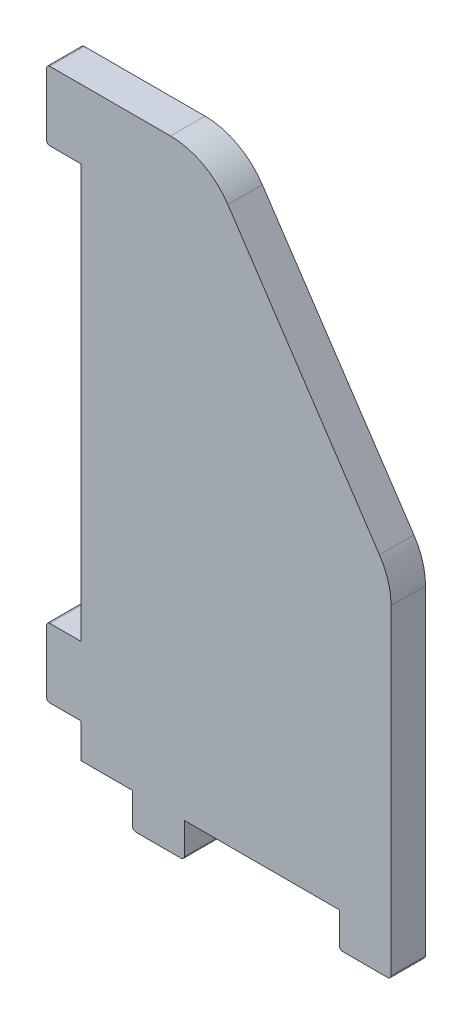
ISO-10303-21;
HEADER;
FILE_DESCRIPTION(('STEP AP214'),'2;1');
FILE_NAME('part.step','',(''),(''),'','','');
FILE_SCHEMA(('AUTOMOTIVE_DESIGN { 1 0 10303 214 1 1 1 1 }'));
ENDSEC;
DATA;
#1=APPLICATION_CONTEXT('core data for automotive mechanical design processes');
#2=APPLICATION_PROTOCOL_DEFINITION('international standard','automotive_design',2000,#1);
#3=PRODUCT_CONTEXT('',#1,'mechanical');
#4=PRODUCT('Part','Part','',(#3));
#5=PRODUCT_RELATED_PRODUCT_CATEGORY('part','',(#4));
#6=PRODUCT_DEFINITION_FORMATION('','',#4);
#7=PRODUCT_DEFINITION_CONTEXT('part definition',#1,'design');
#8=PRODUCT_DEFINITION('design','',#6,#7);
#9=PRODUCT_DEFINITION_SHAPE('','',#8);
#10=(LENGTH_UNIT() NAMED_UNIT(*) SI_UNIT(.MILLI.,.METRE.));
#11=(NAMED_UNIT(*) PLANE_ANGLE_UNIT() SI_UNIT($,.RADIAN.));
#12=(NAMED_UNIT(*) SI_UNIT($,.STERADIAN.) SOLID_ANGLE_UNIT());
#13=UNCERTAINTY_MEASURE_WITH_UNIT(LENGTH_MEASURE(1.E-05),#10,'distance_accuracy_value','');
#14=(GEOMETRIC_REPRESENTATION_CONTEXT(3) GLOBAL_UNCERTAINTY_ASSIGNED_CONTEXT((#13)) GLOBAL_UNIT_ASSIGNED_CONTEXT((#10,
#11,#12)) REPRESENTATION_CONTEXT('',''));
#15=CARTESIAN_POINT('',(0.,0.,0.));
#16=DIRECTION('',(0.,0.,1.));
#17=DIRECTION('',(1.,0.,0.));
#18=AXIS2_PLACEMENT_3D('',#15,#16,#17);
#19=CARTESIAN_POINT('',(0.,0.,20.));
#20=DIRECTION('',(1.,0.,0.));
#21=DIRECTION('',(0.,0.,-1.));
#22=AXIS2_PLACEMENT_3D('',#19,#20,#21);
#23=PLANE('',#22);
#24=DIRECTION('',(0.,-1.,0.));
#25=VECTOR('',#24,1.);
#26=CARTESIAN_POINT('',(0.,0.,0.));
#27=LINE('',#26,#25);
#28=CARTESIAN_POINT('',(0.,20.,0.));
#29=VERTEX_POINT('',#28);
#30=CARTESIAN_POINT('',(0.,0.,0.));
#31=VERTEX_POINT('',#30);
#32=EDGE_CURVE('E237',#29,#31,#27,.T.);
#33=ORIENTED_EDGE('',*,*,#32,.T.);
#34=DIRECTION('',(0.,0.,-1.));
#35=VECTOR('',#34,1.);
#36=CARTESIAN_POINT('',(0.,0.,20.));
#37=LINE('',#36,#35);
#38=CARTESIAN_POINT('',(0.,0.,20.));
#39=VERTEX_POINT('',#38);
#40=EDGE_CURVE('E217',#39,#31,#37,.T.);
#41=ORIENTED_EDGE('',*,*,#40,.F.);
#42=DIRECTION('',(0.,-1.,0.));
#43=VECTOR('',#42,1.);
#44=CARTESIAN_POINT('',(0.,0.,20.));
#45=LINE('',#44,#43);
#46=CARTESIAN_POINT('',(0.,20.,20.));
#47=VERTEX_POINT('',#46);
#48=EDGE_CURVE('E224',#47,#39,#45,.T.);
#49=ORIENTED_EDGE('',*,*,#48,.F.);
#50=DIRECTION('',(0.,0.,-1.));
#51=VECTOR('',#50,1.);
#52=CARTESIAN_POINT('',(0.,20.,20.));
#53=LINE('',#52,#51);
#54=EDGE_CURVE('E364',#47,#29,#53,.T.);
#55=ORIENTED_EDGE('',*,*,#54,.T.);
#56=EDGE_LOOP('',(#33,#41,#49,#55));
#57=FACE_BOUND('',#56,.T.);
#58=ADVANCED_FACE('F32',(#57),#23,.F.);
#59=CARTESIAN_POINT('',(0.,0.,20.));
#60=DIRECTION('',(0.,1.,0.));
#61=DIRECTION('',(-1.,0.,0.));
#62=AXIS2_PLACEMENT_3D('',#59,#60,#61);
#63=PLANE('',#62);
#64=DIRECTION('',(1.,0.,0.));
#65=VECTOR('',#64,1.);
#66=CARTESIAN_POINT('',(0.,0.,0.));
#67=LINE('',#66,#65);
#68=CARTESIAN_POINT('',(30.,0.,0.));
#69=VERTEX_POINT('',#68);
#70=EDGE_CURVE('E442',#31,#69,#67,.T.);
#71=ORIENTED_EDGE('',*,*,#70,.T.);
#72=DIRECTION('',(0.,0.,-1.));
#73=VECTOR('',#72,1.);
#74=CARTESIAN_POINT('',(30.,0.,20.));
#75=LINE('',#74,#73);
#76=CARTESIAN_POINT('',(30.,0.,20.));
#77=VERTEX_POINT('',#76);
#78=EDGE_CURVE('E220',#77,#69,#75,.T.);
#79=ORIENTED_EDGE('',*,*,#78,.F.);
#80=DIRECTION('',(1.,0.,0.));
#81=VECTOR('',#80,1.);
#82=CARTESIAN_POINT('',(0.,0.,20.));
#83=LINE('',#82,#81);
#84=EDGE_CURVE('E213',#39,#77,#83,.T.);
#85=ORIENTED_EDGE('',*,*,#84,.F.);
#86=ORIENTED_EDGE('',*,*,#40,.T.);
#87=EDGE_LOOP('',(#71,#79,#85,#86));
#88=FACE_BOUND('',#87,.T.);
#89=ADVANCED_FACE('F215',(#88),#63,.F.);
#90=CARTESIAN_POINT('',(30.,-20.,20.));
#91=DIRECTION('',(1.,0.,0.));
#92=DIRECTION('',(0.,1.,0.));
#93=AXIS2_PLACEMENT_3D('',#90,#91,#92);
#94=PLANE('',#93);
#95=DIRECTION('',(0.,-1.,0.));
#96=VECTOR('',#95,1.);
#97=CARTESIAN_POINT('',(30.,-20.,0.));
#98=LINE('',#97,#96);
#99=CARTESIAN_POINT('',(30.,-18.,0.));
#100=VERTEX_POINT('',#99);
#101=EDGE_CURVE('E444',#69,#100,#98,.T.);
#102=ORIENTED_EDGE('',*,*,#101,.T.);
#103=DIRECTION('',(0.,0.,-1.));
#104=VECTOR('',#103,1.);
#105=CARTESIAN_POINT('',(30.,-18.,20.));
#106=LINE('',#105,#104);
#107=CARTESIAN_POINT('',(30.,-18.,20.));
#108=VERTEX_POINT('',#107);
#109=EDGE_CURVE('E311',#100,#108,#106,.F.);
#110=ORIENTED_EDGE('',*,*,#109,.T.);
#111=DIRECTION('',(0.,-1.,0.));
#112=VECTOR('',#111,1.);
#113=CARTESIAN_POINT('',(30.,-20.,20.));
#114=LINE('',#113,#112);
#115=EDGE_CURVE('E223',#77,#108,#114,.T.);
#116=ORIENTED_EDGE('',*,*,#115,.F.);
#117=ORIENTED_EDGE('',*,*,#78,.T.);
#118=EDGE_LOOP('',(#102,#110,#116,#117));
#119=FACE_BOUND('',#118,.T.);
#120=ADVANCED_FACE('F502',(#119),#94,.F.);
#121=CARTESIAN_POINT('',(30.,-20.,20.));
#122=DIRECTION('',(0.,1.,0.));
#123=DIRECTION('',(0.,0.,1.));
#124=AXIS2_PLACEMENT_3D('',#121,#122,#123);
#125=PLANE('',#124);
#126=DIRECTION('',(1.,0.,0.));
#127=VECTOR('',#126,1.);
#128=CARTESIAN_POINT('',(30.,-20.,0.));
#129=LINE('',#128,#127);
#130=CARTESIAN_POINT('',(32.,-20.,0.));
#131=VERTEX_POINT('',#130);
#132=CARTESIAN_POINT('',(58.,-20.,0.));
#133=VERTEX_POINT('',#132);
#134=EDGE_CURVE('E391',#131,#133,#129,.T.);
#135=ORIENTED_EDGE('',*,*,#134,.T.);
#136=DIRECTION('',(0.,0.,-1.));
#137=VECTOR('',#136,1.);
#138=CARTESIAN_POINT('',(58.,-20.,20.));
#139=LINE('',#138,#137);
#140=CARTESIAN_POINT('',(58.,-20.,20.));
#141=VERTEX_POINT('',#140);
#142=EDGE_CURVE('E285',#133,#141,#139,.F.);
#143=ORIENTED_EDGE('',*,*,#142,.T.);
#144=DIRECTION('',(1.,0.,0.));
#145=VECTOR('',#144,1.);
#146=CARTESIAN_POINT('',(30.,-20.,20.));
#147=LINE('',#146,#145);
#148=CARTESIAN_POINT('',(32.,-20.,20.));
#149=VERTEX_POINT('',#148);
#150=EDGE_CURVE('E458',#149,#141,#147,.T.);
#151=ORIENTED_EDGE('',*,*,#150,.F.);
#152=DIRECTION('',(0.,0.,-1.));
#153=VECTOR('',#152,1.);
#154=CARTESIAN_POINT('',(32.,-20.,20.));
#155=LINE('',#154,#153);
#156=EDGE_CURVE('E282',#149,#131,#155,.T.);
#157=ORIENTED_EDGE('',*,*,#156,.T.);
#158=EDGE_LOOP('',(#135,#143,#151,#157));
#159=FACE_BOUND('',#158,.T.);
#160=ADVANCED_FACE('F450',(#159),#125,.F.);
#161=CARTESIAN_POINT('',(60.,-20.,20.));
#162=DIRECTION('',(-1.,0.,0.));
#163=DIRECTION('',(0.,0.,1.));
#164=AXIS2_PLACEMENT_3D('',#161,#162,#163);
#165=PLANE('',#164);
#166=DIRECTION('',(0.,1.,0.));
#167=VECTOR('',#166,1.);
#168=CARTESIAN_POINT('',(60.,-20.,20.));
#169=LINE('',#168,#167);
#170=CARTESIAN_POINT('',(60.,-18.,20.));
#171=VERTEX_POINT('',#170);
#172=CARTESIAN_POINT('',(60.,0.,20.));
#173=VERTEX_POINT('',#172);
#174=EDGE_CURVE('E457',#171,#173,#169,.T.);
#175=ORIENTED_EDGE('',*,*,#174,.F.);
#176=DIRECTION('',(0.,0.,-1.));
#177=VECTOR('',#176,1.);
#178=CARTESIAN_POINT('',(60.,-18.,20.));
#179=LINE('',#178,#177);
#180=CARTESIAN_POINT('',(60.,-18.,0.));
#181=VERTEX_POINT('',#180);
#182=EDGE_CURVE('E263',#171,#181,#179,.T.);
#183=ORIENTED_EDGE('',*,*,#182,.T.);
#184=DIRECTION('',(0.,1.,0.));
#185=VECTOR('',#184,1.);
#186=CARTESIAN_POINT('',(60.,-20.,0.));
#187=LINE('',#186,#185);
#188=CARTESIAN_POINT('',(60.,0.,0.));
#189=VERTEX_POINT('',#188);
#190=EDGE_CURVE('E385',#181,#189,#187,.T.);
#191=ORIENTED_EDGE('',*,*,#190,.T.);
#192=DIRECTION('',(0.,0.,-1.));
#193=VECTOR('',#192,1.);
#194=CARTESIAN_POINT('',(60.,0.,20.));
#195=LINE('',#194,#193);
#196=EDGE_CURVE('E243',#173,#189,#195,.T.);
#197=ORIENTED_EDGE('',*,*,#196,.F.);
#198=EDGE_LOOP('',(#175,#183,#191,#197));
#199=FACE_BOUND('',#198,.T.);
#200=ADVANCED_FACE('F459',(#199),#165,.F.);
#201=CARTESIAN_POINT('',(60.,0.,20.));
#202=DIRECTION('',(0.,1.,0.));
#203=DIRECTION('',(-1.,0.,0.));
#204=AXIS2_PLACEMENT_3D('',#201,#202,#203);
#205=PLANE('',#204);
#206=DIRECTION('',(1.,0.,0.));
#207=VECTOR('',#206,1.);
#208=CARTESIAN_POINT('',(60.,0.,0.));
#209=LINE('',#208,#207);
#210=CARTESIAN_POINT('',(150.,0.,0.));
#211=VERTEX_POINT('',#210);
#212=EDGE_CURVE('E380',#189,#211,#209,.T.);
#213=ORIENTED_EDGE('',*,*,#212,.T.);
#214=DIRECTION('',(0.,0.,-1.));
#215=VECTOR('',#214,1.);
#216=CARTESIAN_POINT('',(150.,0.,20.));
#217=LINE('',#216,#215);
#218=CARTESIAN_POINT('',(150.,0.,20.));
#219=VERTEX_POINT('',#218);
#220=EDGE_CURVE('E371',#219,#211,#217,.T.);
#221=ORIENTED_EDGE('',*,*,#220,.F.);
#222=DIRECTION('',(1.,0.,0.));
#223=VECTOR('',#222,1.);
#224=CARTESIAN_POINT('',(60.,0.,20.));
#225=LINE('',#224,#223);
#226=EDGE_CURVE('E381',#173,#219,#225,.T.);
#227=ORIENTED_EDGE('',*,*,#226,.F.);
#228=ORIENTED_EDGE('',*,*,#196,.T.);
#229=EDGE_LOOP('',(#213,#221,#227,#228));
#230=FACE_BOUND('',#229,.T.);
#231=ADVANCED_FACE('F378',(#230),#205,.F.);
#232=CARTESIAN_POINT('',(150.,-20.,20.));
#233=DIRECTION('',(1.,0.,0.));
#234=DIRECTION('',(0.,1.,0.));
#235=AXIS2_PLACEMENT_3D('',#232,#233,#234);
#236=PLANE('',#235);
#237=DIRECTION('',(0.,-1.,0.));
#238=VECTOR('',#237,1.);
#239=CARTESIAN_POINT('',(150.,-20.,0.));
#240=LINE('',#239,#238);
#241=CARTESIAN_POINT('',(150.,-18.,0.));
#242=VERTEX_POINT('',#241);
#243=EDGE_CURVE('E387',#211,#242,#240,.T.);
#244=ORIENTED_EDGE('',*,*,#243,.T.);
#245=DIRECTION('',(0.,0.,-1.));
#246=VECTOR('',#245,1.);
#247=CARTESIAN_POINT('',(150.,-18.,20.));
#248=LINE('',#247,#246);
#249=CARTESIAN_POINT('',(150.,-18.,20.));
#250=VERTEX_POINT('',#249);
#251=EDGE_CURVE('E309',#242,#250,#248,.F.);
#252=ORIENTED_EDGE('',*,*,#251,.T.);
#253=DIRECTION('',(0.,-1.,0.));
#254=VECTOR('',#253,1.);
#255=CARTESIAN_POINT('',(150.,-20.,20.));
#256=LINE('',#255,#254);
#257=EDGE_CURVE('E461',#219,#250,#256,.T.);
#258=ORIENTED_EDGE('',*,*,#257,.F.);
#259=ORIENTED_EDGE('',*,*,#220,.T.);
#260=EDGE_LOOP('',(#244,#252,#258,#259));
#261=FACE_BOUND('',#260,.T.);
#262=ADVANCED_FACE('F667',(#261),#236,.F.);
#263=CARTESIAN_POINT('',(180.,-20.,20.));
#264=DIRECTION('',(0.,1.,0.));
#265=DIRECTION('',(-1.,0.,0.));
#266=AXIS2_PLACEMENT_3D('',#263,#264,#265);
#267=PLANE('',#266);
#268=DIRECTION('',(1.,0.,0.));
#269=VECTOR('',#268,1.);
#270=CARTESIAN_POINT('',(180.,-20.,0.));
#271=LINE('',#270,#269);
#272=CARTESIAN_POINT('',(152.,-20.,0.));
#273=VERTEX_POINT('',#272);
#274=CARTESIAN_POINT('',(178.,-20.,0.));
#275=VERTEX_POINT('',#274);
#276=EDGE_CURVE('E389',#273,#275,#271,.T.);
#277=ORIENTED_EDGE('',*,*,#276,.T.);
#278=DIRECTION('',(0.,0.,-1.));
#279=VECTOR('',#278,1.);
#280=CARTESIAN_POINT('',(178.,-20.,20.));
#281=LINE('',#280,#279);
#282=CARTESIAN_POINT('',(178.,-20.,20.));
#283=VERTEX_POINT('',#282);
#284=EDGE_CURVE('E55',#275,#283,#281,.F.);
#285=ORIENTED_EDGE('',*,*,#284,.T.);
#286=DIRECTION('',(1.,0.,0.));
#287=VECTOR('',#286,1.);
#288=CARTESIAN_POINT('',(180.,-20.,20.));
#289=LINE('',#288,#287);
#290=CARTESIAN_POINT('',(152.,-20.,20.));
#291=VERTEX_POINT('',#290);
#292=EDGE_CURVE('E468',#291,#283,#289,.T.);
#293=ORIENTED_EDGE('',*,*,#292,.F.);
#294=DIRECTION('',(0.,0.,-1.));
#295=VECTOR('',#294,1.);
#296=CARTESIAN_POINT('',(152.,-20.,20.));
#297=LINE('',#296,#295);
#298=EDGE_CURVE('E305',#291,#273,#297,.T.);
#299=ORIENTED_EDGE('',*,*,#298,.T.);
#300=EDGE_LOOP('',(#277,#285,#293,#299));
#301=FACE_BOUND('',#300,.T.);
#302=ADVANCED_FACE('F655',(#301),#267,.F.);
#303=CARTESIAN_POINT('',(180.,0.,20.));
#304=DIRECTION('',(-1.,0.,0.));
#305=DIRECTION('',(0.,0.,1.));
#306=AXIS2_PLACEMENT_3D('',#303,#304,#305);
#307=PLANE('',#306);
#308=DIRECTION('',(0.,1.,0.));
#309=VECTOR('',#308,1.);
#310=CARTESIAN_POINT('',(180.,0.,20.));
#311=LINE('',#310,#309);
#312=CARTESIAN_POINT('',(180.,-18.,20.));
#313=VERTEX_POINT('',#312);
#314=CARTESIAN_POINT('',(180.,167.893724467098,20.));
#315=VERTEX_POINT('',#314);
#316=EDGE_CURVE('E470',#313,#315,#311,.T.);
#317=ORIENTED_EDGE('',*,*,#316,.F.);
#318=DIRECTION('',(0.,0.,-1.));
#319=VECTOR('',#318,1.);
#320=CARTESIAN_POINT('',(180.,-18.,20.));
#321=LINE('',#320,#319);
#322=CARTESIAN_POINT('',(180.,-18.,0.));
#323=VERTEX_POINT('',#322);
#324=EDGE_CURVE('E302',#313,#323,#321,.T.);
#325=ORIENTED_EDGE('',*,*,#324,.T.);
#326=DIRECTION('',(0.,1.,0.));
#327=VECTOR('',#326,1.);
#328=CARTESIAN_POINT('',(180.,0.,0.));
#329=LINE('',#328,#327);
#330=CARTESIAN_POINT('',(180.,167.893724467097,0.));
#331=VERTEX_POINT('',#330);
#332=EDGE_CURVE('E396',#323,#331,#329,.T.);
#333=ORIENTED_EDGE('',*,*,#332,.T.);
#334=DIRECTION('',(0.,0.,-1.));
#335=VECTOR('',#334,1.);
#336=CARTESIAN_POINT('',(180.,167.893724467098,20.));
#337=LINE('',#336,#335);
#338=EDGE_CURVE('E260',#331,#315,#337,.F.);
#339=ORIENTED_EDGE('',*,*,#338,.T.);
#340=EDGE_LOOP('',(#317,#325,#333,#339));
#341=FACE_BOUND('',#340,.T.);
#342=ADVANCED_FACE('F650',(#341),#307,.F.);
#343=CARTESIAN_POINT('',(180.,180.,20.));
#344=DIRECTION('',(-0.832170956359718,-0.554519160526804,0.));
#345=DIRECTION('',(0.554519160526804,-0.832170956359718,0.));
#346=AXIS2_PLACEMENT_3D('',#343,#344,#345);
#347=PLANE('',#346);
#348=DIRECTION('',(-0.554519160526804,0.832170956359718,0.));
#349=VECTOR('',#348,1.);
#350=CARTESIAN_POINT('',(180.,180.,0.));
#351=LINE('',#350,#349);
#352=CARTESIAN_POINT('',(173.286838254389,190.07449088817,0.));
#353=VERTEX_POINT('',#352);
#354=CARTESIAN_POINT('',(85.2574971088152,322.180766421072,0.));
#355=VERTEX_POINT('',#354);
#356=EDGE_CURVE('E398',#353,#355,#351,.T.);
#357=ORIENTED_EDGE('',*,*,#356,.T.);
#358=DIRECTION('',(0.,0.,-1.));
#359=VECTOR('',#358,1.);
#360=CARTESIAN_POINT('',(85.2574971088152,322.180766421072,20.));
#361=LINE('',#360,#359);
#362=CARTESIAN_POINT('',(85.2574971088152,322.180766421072,20.));
#363=VERTEX_POINT('',#362);
#364=EDGE_CURVE('E254',#355,#363,#361,.F.);
#365=ORIENTED_EDGE('',*,*,#364,.T.);
#366=DIRECTION('',(-0.554519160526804,0.832170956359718,0.));
#367=VECTOR('',#366,1.);
#368=CARTESIAN_POINT('',(180.,180.,20.));
#369=LINE('',#368,#367);
#370=CARTESIAN_POINT('',(173.286838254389,190.07449088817,20.));
#371=VERTEX_POINT('',#370);
#372=EDGE_CURVE('E434',#371,#363,#369,.T.);
#373=ORIENTED_EDGE('',*,*,#372,.F.);
#374=DIRECTION('',(0.,0.,-1.));
#375=VECTOR('',#374,1.);
#376=CARTESIAN_POINT('',(173.286838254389,190.07449088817,20.));
#377=LINE('',#376,#375);
#378=EDGE_CURVE('E251',#371,#353,#377,.T.);
#379=ORIENTED_EDGE('',*,*,#378,.T.);
#380=EDGE_LOOP('',(#357,#365,#373,#379));
#381=FACE_BOUND('',#380,.T.);
#382=ADVANCED_FACE('F643',(#381),#347,.F.);
#383=CARTESIAN_POINT('',(-20.,340.,20.));
#384=DIRECTION('',(0.,-1.,0.));
#385=DIRECTION('',(0.,0.,-1.));
#386=AXIS2_PLACEMENT_3D('',#383,#384,#385);
#387=PLANE('',#386);
#388=DIRECTION('',(-1.,0.,0.));
#389=VECTOR('',#388,1.);
#390=CARTESIAN_POINT('',(-20.,340.,0.));
#391=LINE('',#390,#389);
#392=CARTESIAN_POINT('',(51.9706588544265,340.,0.));
#393=VERTEX_POINT('',#392);
#394=CARTESIAN_POINT('',(-18.,340.,0.));
#395=VERTEX_POINT('',#394);
#396=EDGE_CURVE('E401',#393,#395,#391,.T.);
#397=ORIENTED_EDGE('',*,*,#396,.T.);
#398=DIRECTION('',(0.,0.,-1.));
#399=VECTOR('',#398,1.);
#400=CARTESIAN_POINT('',(-18.,340.,20.));
#401=LINE('',#400,#399);
#402=CARTESIAN_POINT('',(-18.,340.,20.));
#403=VERTEX_POINT('',#402);
#404=EDGE_CURVE('E321',#395,#403,#401,.F.);
#405=ORIENTED_EDGE('',*,*,#404,.T.);
#406=DIRECTION('',(-1.,0.,0.));
#407=VECTOR('',#406,1.);
#408=CARTESIAN_POINT('',(0.,340.,20.));
#409=LINE('',#408,#407);
#410=CARTESIAN_POINT('',(51.9706588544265,340.,20.));
#411=VERTEX_POINT('',#410);
#412=EDGE_CURVE('E431',#411,#403,#409,.T.);
#413=ORIENTED_EDGE('',*,*,#412,.F.);
#414=DIRECTION('',(0.,0.,-1.));
#415=VECTOR('',#414,1.);
#416=CARTESIAN_POINT('',(51.9706588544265,340.,20.));
#417=LINE('',#416,#415);
#418=EDGE_CURVE('E238',#411,#393,#417,.T.);
#419=ORIENTED_EDGE('',*,*,#418,.T.);
#420=EDGE_LOOP('',(#397,#405,#413,#419));
#421=FACE_BOUND('',#420,.T.);
#422=ADVANCED_FACE('F484',(#421),#387,.F.);
#423=CARTESIAN_POINT('',(-20.,300.,20.));
#424=DIRECTION('',(1.,0.,0.));
#425=DIRECTION('',(0.,0.,-1.));
#426=AXIS2_PLACEMENT_3D('',#423,#424,#425);
#427=PLANE('',#426);
#428=DIRECTION('',(0.,-1.,0.));
#429=VECTOR('',#428,1.);
#430=CARTESIAN_POINT('',(-20.,300.,0.));
#431=LINE('',#430,#429);
#432=CARTESIAN_POINT('',(-20.,338.,0.));
#433=VERTEX_POINT('',#432);
#434=CARTESIAN_POINT('',(-20.,302.,0.));
#435=VERTEX_POINT('',#434);
#436=EDGE_CURVE('E404',#433,#435,#431,.T.);
#437=ORIENTED_EDGE('',*,*,#436,.T.);
#438=DIRECTION('',(0.,0.,-1.));
#439=VECTOR('',#438,1.);
#440=CARTESIAN_POINT('',(-20.,302.,20.));
#441=LINE('',#440,#439);
#442=CARTESIAN_POINT('',(-20.,302.,20.));
#443=VERTEX_POINT('',#442);
#444=EDGE_CURVE('E319',#435,#443,#441,.F.);
#445=ORIENTED_EDGE('',*,*,#444,.T.);
#446=DIRECTION('',(0.,-1.,0.));
#447=VECTOR('',#446,1.);
#448=CARTESIAN_POINT('',(-20.,300.,20.));
#449=LINE('',#448,#447);
#450=CARTESIAN_POINT('',(-20.,338.,20.));
#451=VERTEX_POINT('',#450);
#452=EDGE_CURVE('E427',#451,#443,#449,.T.);
#453=ORIENTED_EDGE('',*,*,#452,.F.);
#454=DIRECTION('',(0.,0.,-1.));
#455=VECTOR('',#454,1.);
#456=CARTESIAN_POINT('',(-20.,338.,20.));
#457=LINE('',#456,#455);
#458=EDGE_CURVE('E316',#451,#433,#457,.T.);
#459=ORIENTED_EDGE('',*,*,#458,.T.);
#460=EDGE_LOOP('',(#437,#445,#453,#459));
#461=FACE_BOUND('',#460,.T.);
#462=ADVANCED_FACE('F426',(#461),#427,.F.);
#463=CARTESIAN_POINT('',(0.,300.,20.));
#464=DIRECTION('',(0.,1.,0.));
#465=DIRECTION('',(0.,0.,1.));
#466=AXIS2_PLACEMENT_3D('',#463,#464,#465);
#467=PLANE('',#466);
#468=DIRECTION('',(1.,0.,0.));
#469=VECTOR('',#468,1.);
#470=CARTESIAN_POINT('',(0.,300.,20.));
#471=LINE('',#470,#469);
#472=CARTESIAN_POINT('',(-18.,300.,20.));
#473=VERTEX_POINT('',#472);
#474=CARTESIAN_POINT('',(0.,300.,20.));
#475=VERTEX_POINT('',#474);
#476=EDGE_CURVE('E418',#473,#475,#471,.T.);
#477=ORIENTED_EDGE('',*,*,#476,.F.);
#478=DIRECTION('',(0.,0.,-1.));
#479=VECTOR('',#478,1.);
#480=CARTESIAN_POINT('',(-18.,300.,20.));
#481=LINE('',#480,#479);
#482=CARTESIAN_POINT('',(-18.,300.,0.));
#483=VERTEX_POINT('',#482);
#484=EDGE_CURVE('E313',#473,#483,#481,.T.);
#485=ORIENTED_EDGE('',*,*,#484,.T.);
#486=DIRECTION('',(1.,0.,0.));
#487=VECTOR('',#486,1.);
#488=CARTESIAN_POINT('',(0.,300.,0.));
#489=LINE('',#488,#487);
#490=CARTESIAN_POINT('',(0.,300.,0.));
#491=VERTEX_POINT('',#490);
#492=EDGE_CURVE('E407',#483,#491,#489,.T.);
#493=ORIENTED_EDGE('',*,*,#492,.T.);
#494=DIRECTION('',(0.,0.,-1.));
#495=VECTOR('',#494,1.);
#496=CARTESIAN_POINT('',(0.,300.,20.));
#497=LINE('',#496,#495);
#498=EDGE_CURVE('E368',#475,#491,#497,.T.);
#499=ORIENTED_EDGE('',*,*,#498,.F.);
#500=EDGE_LOOP('',(#477,#485,#493,#499));
#501=FACE_BOUND('',#500,.T.);
#502=ADVANCED_FACE('F416',(#501),#467,.F.);
#503=CARTESIAN_POINT('',(0.,60.,20.));
#504=DIRECTION('',(1.,0.,0.));
#505=DIRECTION('',(0.,0.,-1.));
#506=AXIS2_PLACEMENT_3D('',#503,#504,#505);
#507=PLANE('',#506);
#508=DIRECTION('',(0.,-1.,0.));
#509=VECTOR('',#508,1.);
#510=CARTESIAN_POINT('',(0.,60.,0.));
#511=LINE('',#510,#509);
#512=CARTESIAN_POINT('',(0.,60.,0.));
#513=VERTEX_POINT('',#512);
#514=EDGE_CURVE('E360',#491,#513,#511,.T.);
#515=ORIENTED_EDGE('',*,*,#514,.T.);
#516=DIRECTION('',(0.,0.,-1.));
#517=VECTOR('',#516,1.);
#518=CARTESIAN_POINT('',(0.,60.,20.));
#519=LINE('',#518,#517);
#520=CARTESIAN_POINT('',(0.,60.,20.));
#521=VERTEX_POINT('',#520);
#522=EDGE_CURVE('E366',#521,#513,#519,.T.);
#523=ORIENTED_EDGE('',*,*,#522,.F.);
#524=DIRECTION('',(0.,-1.,0.));
#525=VECTOR('',#524,1.);
#526=CARTESIAN_POINT('',(0.,60.,20.));
#527=LINE('',#526,#525);
#528=EDGE_CURVE('E342',#475,#521,#527,.T.);
#529=ORIENTED_EDGE('',*,*,#528,.F.);
#530=ORIENTED_EDGE('',*,*,#498,.T.);
#531=EDGE_LOOP('',(#515,#523,#529,#530));
#532=FACE_BOUND('',#531,.T.);
#533=ADVANCED_FACE('F410',(#532),#507,.F.);
#534=CARTESIAN_POINT('',(-20.,60.,20.));
#535=DIRECTION('',(0.,-1.,0.));
#536=DIRECTION('',(0.,0.,-1.));
#537=AXIS2_PLACEMENT_3D('',#534,#535,#536);
#538=PLANE('',#537);
#539=DIRECTION('',(-1.,0.,0.));
#540=VECTOR('',#539,1.);
#541=CARTESIAN_POINT('',(-20.,60.,0.));
#542=LINE('',#541,#540);
#543=CARTESIAN_POINT('',(-18.,60.,0.));
#544=VERTEX_POINT('',#543);
#545=EDGE_CURVE('E336',#513,#544,#542,.T.);
#546=ORIENTED_EDGE('',*,*,#545,.T.);
#547=DIRECTION('',(0.,0.,-1.));
#548=VECTOR('',#547,1.);
#549=CARTESIAN_POINT('',(-18.,60.,20.));
#550=LINE('',#549,#548);
#551=CARTESIAN_POINT('',(-18.,60.,20.));
#552=VERTEX_POINT('',#551);
#553=EDGE_CURVE('E40',#544,#552,#550,.F.);
#554=ORIENTED_EDGE('',*,*,#553,.T.);
#555=DIRECTION('',(-1.,0.,0.));
#556=VECTOR('',#555,1.);
#557=CARTESIAN_POINT('',(-20.,60.,20.));
#558=LINE('',#557,#556);
#559=EDGE_CURVE('E334',#521,#552,#558,.T.);
#560=ORIENTED_EDGE('',*,*,#559,.F.);
#561=ORIENTED_EDGE('',*,*,#522,.T.);
#562=EDGE_LOOP('',(#546,#554,#560,#561));
#563=FACE_BOUND('',#562,.T.);
#564=ADVANCED_FACE('F332',(#563),#538,.F.);
#565=CARTESIAN_POINT('',(-20.,20.,20.));
#566=DIRECTION('',(1.,0.,0.));
#567=DIRECTION('',(0.,0.,-1.));
#568=AXIS2_PLACEMENT_3D('',#565,#566,#567);
#569=PLANE('',#568);
#570=DIRECTION('',(0.,-1.,0.));
#571=VECTOR('',#570,1.);
#572=CARTESIAN_POINT('',(-20.,20.,20.));
#573=LINE('',#572,#571);
#574=CARTESIAN_POINT('',(-20.,58.,20.));
#575=VERTEX_POINT('',#574);
#576=CARTESIAN_POINT('',(-20.,22.,20.));
#577=VERTEX_POINT('',#576);
#578=EDGE_CURVE('E344',#575,#577,#573,.T.);
#579=ORIENTED_EDGE('',*,*,#578,.F.);
#580=DIRECTION('',(0.,0.,-1.));
#581=VECTOR('',#580,1.);
#582=CARTESIAN_POINT('',(-20.,58.,20.));
#583=LINE('',#582,#581);
#584=CARTESIAN_POINT('',(-20.,58.,0.));
#585=VERTEX_POINT('',#584);
#586=EDGE_CURVE('E325',#575,#585,#583,.T.);
#587=ORIENTED_EDGE('',*,*,#586,.T.);
#588=DIRECTION('',(0.,-1.,0.));
#589=VECTOR('',#588,1.);
#590=CARTESIAN_POINT('',(-20.,20.,0.));
#591=LINE('',#590,#589);
#592=CARTESIAN_POINT('',(-20.,22.,0.));
#593=VERTEX_POINT('',#592);
#594=EDGE_CURVE('E352',#585,#593,#591,.T.);
#595=ORIENTED_EDGE('',*,*,#594,.T.);
#596=DIRECTION('',(0.,0.,-1.));
#597=VECTOR('',#596,1.);
#598=CARTESIAN_POINT('',(-20.,22.,20.));
#599=LINE('',#598,#597);
#600=EDGE_CURVE('E323',#593,#577,#599,.F.);
#601=ORIENTED_EDGE('',*,*,#600,.T.);
#602=EDGE_LOOP('',(#579,#587,#595,#601));
#603=FACE_BOUND('',#602,.T.);
#604=ADVANCED_FACE('F351',(#603),#569,.F.);
#605=CARTESIAN_POINT('',(0.,20.,20.));
#606=DIRECTION('',(0.,1.,0.));
#607=DIRECTION('',(-1.,0.,0.));
#608=AXIS2_PLACEMENT_3D('',#605,#606,#607);
#609=PLANE('',#608);
#610=DIRECTION('',(1.,0.,0.));
#611=VECTOR('',#610,1.);
#612=CARTESIAN_POINT('',(0.,20.,20.));
#613=LINE('',#612,#611);
#614=CARTESIAN_POINT('',(-18.,20.,20.));
#615=VERTEX_POINT('',#614);
#616=EDGE_CURVE('E230',#615,#47,#613,.T.);
#617=ORIENTED_EDGE('',*,*,#616,.F.);
#618=DIRECTION('',(0.,0.,-1.));
#619=VECTOR('',#618,1.);
#620=CARTESIAN_POINT('',(-18.,20.,20.));
#621=LINE('',#620,#619);
#622=CARTESIAN_POINT('',(-18.,20.,0.));
#623=VERTEX_POINT('',#622);
#624=EDGE_CURVE('E11',#615,#623,#621,.T.);
#625=ORIENTED_EDGE('',*,*,#624,.T.);
#626=DIRECTION('',(1.,0.,0.));
#627=VECTOR('',#626,1.);
#628=CARTESIAN_POINT('',(0.,20.,0.));
#629=LINE('',#628,#627);
#630=EDGE_CURVE('E234',#623,#29,#629,.T.);
#631=ORIENTED_EDGE('',*,*,#630,.T.);
#632=ORIENTED_EDGE('',*,*,#54,.F.);
#633=EDGE_LOOP('',(#617,#625,#631,#632));
#634=FACE_BOUND('',#633,.T.);
#635=ADVANCED_FACE('F531',(#634),#609,.F.);
#636=CARTESIAN_POINT('',(0.,0.,20.));
#637=DIRECTION('',(0.,0.,1.));
#638=DIRECTION('',(1.,0.,0.));
#639=AXIS2_PLACEMENT_3D('',#636,#637,#638);
#640=PLANE('',#639);
#641=ORIENTED_EDGE('',*,*,#150,.T.);
#642=CARTESIAN_POINT('',(58.,-18.,20.));
#643=DIRECTION('',(0.,0.,1.));
#644=DIRECTION('',(1.,0.,0.));
#645=AXIS2_PLACEMENT_3D('',#642,#643,#644);
#646=CIRCLE('',#645,2.);
#647=EDGE_CURVE('E300',#141,#171,#646,.T.);
#648=ORIENTED_EDGE('',*,*,#647,.T.);
#649=ORIENTED_EDGE('',*,*,#174,.T.);
#650=ORIENTED_EDGE('',*,*,#226,.T.);
#651=ORIENTED_EDGE('',*,*,#257,.T.);
#652=CARTESIAN_POINT('',(152.,-18.,20.));
#653=DIRECTION('',(0.,0.,1.));
#654=DIRECTION('',(1.,0.,0.));
#655=AXIS2_PLACEMENT_3D('',#652,#653,#654);
#656=CIRCLE('',#655,2.);
#657=EDGE_CURVE('E297',#250,#291,#656,.T.);
#658=ORIENTED_EDGE('',*,*,#657,.T.);
#659=ORIENTED_EDGE('',*,*,#292,.T.);
#660=CARTESIAN_POINT('',(178.,-18.,20.));
#661=DIRECTION('',(0.,0.,1.));
#662=DIRECTION('',(1.,0.,0.));
#663=AXIS2_PLACEMENT_3D('',#660,#661,#662);
#664=CIRCLE('',#663,2.);
#665=EDGE_CURVE('E47',#283,#313,#664,.T.);
#666=ORIENTED_EDGE('',*,*,#665,.T.);
#667=ORIENTED_EDGE('',*,*,#316,.T.);
#668=CARTESIAN_POINT('',(140.,167.893724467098,20.));
#669=DIRECTION('',(0.,0.,1.));
#670=DIRECTION('',(1.,0.,0.));
#671=AXIS2_PLACEMENT_3D('',#668,#669,#670);
#672=CIRCLE('',#671,40.);
#673=EDGE_CURVE('E256',#315,#371,#672,.T.);
#674=ORIENTED_EDGE('',*,*,#673,.T.);
#675=ORIENTED_EDGE('',*,*,#372,.T.);
#676=CARTESIAN_POINT('',(51.9706588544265,300.,20.));
#677=DIRECTION('',(0.,0.,1.));
#678=DIRECTION('',(1.,0.,0.));
#679=AXIS2_PLACEMENT_3D('',#676,#677,#678);
#680=CIRCLE('',#679,40.);
#681=EDGE_CURVE('E258',#363,#411,#680,.T.);
#682=ORIENTED_EDGE('',*,*,#681,.T.);
#683=ORIENTED_EDGE('',*,*,#412,.T.);
#684=CARTESIAN_POINT('',(-18.,338.,20.));
#685=DIRECTION('',(0.,0.,1.));
#686=DIRECTION('',(1.,0.,0.));
#687=AXIS2_PLACEMENT_3D('',#684,#685,#686);
#688=CIRCLE('',#687,2.);
#689=EDGE_CURVE('E291',#403,#451,#688,.T.);
#690=ORIENTED_EDGE('',*,*,#689,.T.);
#691=ORIENTED_EDGE('',*,*,#452,.T.);
#692=CARTESIAN_POINT('',(-18.,302.,20.));
#693=DIRECTION('',(0.,0.,1.));
#694=DIRECTION('',(1.,0.,0.));
#695=AXIS2_PLACEMENT_3D('',#692,#693,#694);
#696=CIRCLE('',#695,2.);
#697=EDGE_CURVE('E293',#443,#473,#696,.T.);
#698=ORIENTED_EDGE('',*,*,#697,.T.);
#699=ORIENTED_EDGE('',*,*,#476,.T.);
#700=ORIENTED_EDGE('',*,*,#528,.T.);
#701=ORIENTED_EDGE('',*,*,#559,.T.);
#702=CARTESIAN_POINT('',(-18.,58.,20.));
#703=DIRECTION('',(0.,0.,1.));
#704=DIRECTION('',(1.,0.,0.));
#705=AXIS2_PLACEMENT_3D('',#702,#703,#704);
#706=CIRCLE('',#705,2.);
#707=EDGE_CURVE('E289',#552,#575,#706,.T.);
#708=ORIENTED_EDGE('',*,*,#707,.T.);
#709=ORIENTED_EDGE('',*,*,#578,.T.);
#710=CARTESIAN_POINT('',(-18.,22.,20.));
#711=DIRECTION('',(0.,0.,1.));
#712=DIRECTION('',(1.,0.,0.));
#713=AXIS2_PLACEMENT_3D('',#710,#711,#712);
#714=CIRCLE('',#713,2.);
#715=EDGE_CURVE('E287',#577,#615,#714,.T.);
#716=ORIENTED_EDGE('',*,*,#715,.T.);
#717=ORIENTED_EDGE('',*,*,#616,.T.);
#718=ORIENTED_EDGE('',*,*,#48,.T.);
#719=ORIENTED_EDGE('',*,*,#84,.T.);
#720=ORIENTED_EDGE('',*,*,#115,.T.);
#721=CARTESIAN_POINT('',(32.,-18.,20.));
#722=DIRECTION('',(0.,0.,1.));
#723=DIRECTION('',(1.,0.,0.));
#724=AXIS2_PLACEMENT_3D('',#721,#722,#723);
#725=CIRCLE('',#724,2.);
#726=EDGE_CURVE('E295',#108,#149,#725,.T.);
#727=ORIENTED_EDGE('',*,*,#726,.T.);
#728=EDGE_LOOP('',(#641,#648,#649,#650,#651,#658,#659,#666,#667,#674,#675,#682,#683,#690,#691,
#698,#699,#700,#701,#708,#709,#716,#717,#718,#719,#720,#727));
#729=FACE_BOUND('',#728,.T.);
#730=ADVANCED_FACE('F228',(#729),#640,.T.);
#731=CARTESIAN_POINT('',(0.,0.,0.));
#732=DIRECTION('',(0.,0.,1.));
#733=DIRECTION('',(1.,0.,0.));
#734=AXIS2_PLACEMENT_3D('',#731,#732,#733);
#735=PLANE('',#734);
#736=ORIENTED_EDGE('',*,*,#190,.F.);
#737=CARTESIAN_POINT('',(58.,-18.,0.));
#738=DIRECTION('',(0.,0.,1.));
#739=DIRECTION('',(1.,0.,0.));
#740=AXIS2_PLACEMENT_3D('',#737,#738,#739);
#741=CIRCLE('',#740,2.);
#742=EDGE_CURVE('E280',#181,#133,#741,.F.);
#743=ORIENTED_EDGE('',*,*,#742,.T.);
#744=ORIENTED_EDGE('',*,*,#134,.F.);
#745=CARTESIAN_POINT('',(32.,-18.,0.));
#746=DIRECTION('',(0.,0.,1.));
#747=DIRECTION('',(1.,0.,0.));
#748=AXIS2_PLACEMENT_3D('',#745,#746,#747);
#749=CIRCLE('',#748,2.);
#750=EDGE_CURVE('E274',#131,#100,#749,.F.);
#751=ORIENTED_EDGE('',*,*,#750,.T.);
#752=ORIENTED_EDGE('',*,*,#101,.F.);
#753=ORIENTED_EDGE('',*,*,#70,.F.);
#754=ORIENTED_EDGE('',*,*,#32,.F.);
#755=ORIENTED_EDGE('',*,*,#630,.F.);
#756=CARTESIAN_POINT('',(-18.,22.,0.));
#757=DIRECTION('',(0.,0.,1.));
#758=DIRECTION('',(1.,0.,0.));
#759=AXIS2_PLACEMENT_3D('',#756,#757,#758);
#760=CIRCLE('',#759,2.);
#761=EDGE_CURVE('E266',#623,#593,#760,.F.);
#762=ORIENTED_EDGE('',*,*,#761,.T.);
#763=ORIENTED_EDGE('',*,*,#594,.F.);
#764=CARTESIAN_POINT('',(-18.,58.,0.));
#765=DIRECTION('',(0.,0.,1.));
#766=DIRECTION('',(1.,0.,0.));
#767=AXIS2_PLACEMENT_3D('',#764,#765,#766);
#768=CIRCLE('',#767,2.);
#769=EDGE_CURVE('E268',#585,#544,#768,.F.);
#770=ORIENTED_EDGE('',*,*,#769,.T.);
#771=ORIENTED_EDGE('',*,*,#545,.F.);
#772=ORIENTED_EDGE('',*,*,#514,.F.);
#773=ORIENTED_EDGE('',*,*,#492,.F.);
#774=CARTESIAN_POINT('',(-18.,302.,0.));
#775=DIRECTION('',(0.,0.,1.));
#776=DIRECTION('',(1.,0.,0.));
#777=AXIS2_PLACEMENT_3D('',#774,#775,#776);
#778=CIRCLE('',#777,2.);
#779=EDGE_CURVE('E272',#483,#435,#778,.F.);
#780=ORIENTED_EDGE('',*,*,#779,.T.);
#781=ORIENTED_EDGE('',*,*,#436,.F.);
#782=CARTESIAN_POINT('',(-18.,338.,0.));
#783=DIRECTION('',(0.,0.,1.));
#784=DIRECTION('',(1.,0.,0.));
#785=AXIS2_PLACEMENT_3D('',#782,#783,#784);
#786=CIRCLE('',#785,2.);
#787=EDGE_CURVE('E270',#433,#395,#786,.F.);
#788=ORIENTED_EDGE('',*,*,#787,.T.);
#789=ORIENTED_EDGE('',*,*,#396,.F.);
#790=CARTESIAN_POINT('',(51.9706588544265,300.,0.));
#791=DIRECTION('',(0.,0.,1.));
#792=DIRECTION('',(1.,0.,0.));
#793=AXIS2_PLACEMENT_3D('',#790,#791,#792);
#794=CIRCLE('',#793,40.);
#795=EDGE_CURVE('E249',#393,#355,#794,.F.);
#796=ORIENTED_EDGE('',*,*,#795,.T.);
#797=ORIENTED_EDGE('',*,*,#356,.F.);
#798=CARTESIAN_POINT('',(140.,167.893724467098,0.));
#799=DIRECTION('',(0.,0.,1.));
#800=DIRECTION('',(1.,0.,0.));
#801=AXIS2_PLACEMENT_3D('',#798,#799,#800);
#802=CIRCLE('',#801,40.);
#803=EDGE_CURVE('E241',#353,#331,#802,.F.);
#804=ORIENTED_EDGE('',*,*,#803,.T.);
#805=ORIENTED_EDGE('',*,*,#332,.F.);
#806=CARTESIAN_POINT('',(178.,-18.,0.));
#807=DIRECTION('',(0.,0.,1.));
#808=DIRECTION('',(1.,0.,0.));
#809=AXIS2_PLACEMENT_3D('',#806,#807,#808);
#810=CIRCLE('',#809,2.);
#811=EDGE_CURVE('E278',#323,#275,#810,.F.);
#812=ORIENTED_EDGE('',*,*,#811,.T.);
#813=ORIENTED_EDGE('',*,*,#276,.F.);
#814=CARTESIAN_POINT('',(152.,-18.,0.));
#815=DIRECTION('',(0.,0.,1.));
#816=DIRECTION('',(1.,0.,0.));
#817=AXIS2_PLACEMENT_3D('',#814,#815,#816);
#818=CIRCLE('',#817,2.);
#819=EDGE_CURVE('E276',#273,#242,#818,.F.);
#820=ORIENTED_EDGE('',*,*,#819,.T.);
#821=ORIENTED_EDGE('',*,*,#243,.F.);
#822=ORIENTED_EDGE('',*,*,#212,.F.);
#823=EDGE_LOOP('',(#736,#743,#744,#751,#752,#753,#754,#755,#762,#763,#770,#771,#772,#773,#780,
#781,#788,#789,#796,#797,#804,#805,#812,#813,#820,#821,#822));
#824=FACE_BOUND('',#823,.T.);
#825=ADVANCED_FACE('F356',(#824),#735,.F.);
#826=CARTESIAN_POINT('',(51.9706588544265,300.,20.));
#827=DIRECTION('',(0.,0.,-1.));
#828=DIRECTION('',(-1.,0.,0.));
#829=AXIS2_PLACEMENT_3D('',#826,#827,#828);
#830=CYLINDRICAL_SURFACE('',#829,40.);
#831=ORIENTED_EDGE('',*,*,#681,.F.);
#832=ORIENTED_EDGE('',*,*,#364,.F.);
#833=ORIENTED_EDGE('',*,*,#795,.F.);
#834=ORIENTED_EDGE('',*,*,#418,.F.);
#835=EDGE_LOOP('',(#831,#832,#833,#834));
#836=FACE_BOUND('',#835,.T.);
#837=ADVANCED_FACE('F481',(#836),#830,.T.);
#838=CARTESIAN_POINT('',(140.,167.893724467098,20.));
#839=DIRECTION('',(0.,0.,-1.));
#840=DIRECTION('',(-1.,0.,0.));
#841=AXIS2_PLACEMENT_3D('',#838,#839,#840);
#842=CYLINDRICAL_SURFACE('',#841,40.);
#843=ORIENTED_EDGE('',*,*,#673,.F.);
#844=ORIENTED_EDGE('',*,*,#338,.F.);
#845=ORIENTED_EDGE('',*,*,#803,.F.);
#846=ORIENTED_EDGE('',*,*,#378,.F.);
#847=EDGE_LOOP('',(#843,#844,#845,#846));
#848=FACE_BOUND('',#847,.T.);
#849=ADVANCED_FACE('F508',(#848),#842,.T.);
#850=CARTESIAN_POINT('',(58.,-18.,20.));
#851=DIRECTION('',(0.,0.,-1.));
#852=DIRECTION('',(-1.,0.,0.));
#853=AXIS2_PLACEMENT_3D('',#850,#851,#852);
#854=CYLINDRICAL_SURFACE('',#853,2.);
#855=ORIENTED_EDGE('',*,*,#647,.F.);
#856=ORIENTED_EDGE('',*,*,#142,.F.);
#857=ORIENTED_EDGE('',*,*,#742,.F.);
#858=ORIENTED_EDGE('',*,*,#182,.F.);
#859=EDGE_LOOP('',(#855,#856,#857,#858));
#860=FACE_BOUND('',#859,.T.);
#861=ADVANCED_FACE('F455',(#860),#854,.T.);
#862=CARTESIAN_POINT('',(178.,-18.,20.));
#863=DIRECTION('',(0.,0.,-1.));
#864=DIRECTION('',(-1.,0.,0.));
#865=AXIS2_PLACEMENT_3D('',#862,#863,#864);
#866=CYLINDRICAL_SURFACE('',#865,2.);
#867=ORIENTED_EDGE('',*,*,#665,.F.);
#868=ORIENTED_EDGE('',*,*,#284,.F.);
#869=ORIENTED_EDGE('',*,*,#811,.F.);
#870=ORIENTED_EDGE('',*,*,#324,.F.);
#871=EDGE_LOOP('',(#867,#868,#869,#870));
#872=FACE_BOUND('',#871,.T.);
#873=ADVANCED_FACE('F514',(#872),#866,.T.);
#874=CARTESIAN_POINT('',(152.,-18.,20.));
#875=DIRECTION('',(0.,0.,-1.));
#876=DIRECTION('',(-1.,0.,0.));
#877=AXIS2_PLACEMENT_3D('',#874,#875,#876);
#878=CYLINDRICAL_SURFACE('',#877,2.);
#879=ORIENTED_EDGE('',*,*,#657,.F.);
#880=ORIENTED_EDGE('',*,*,#251,.F.);
#881=ORIENTED_EDGE('',*,*,#819,.F.);
#882=ORIENTED_EDGE('',*,*,#298,.F.);
#883=EDGE_LOOP('',(#879,#880,#881,#882));
#884=FACE_BOUND('',#883,.T.);
#885=ADVANCED_FACE('F517',(#884),#878,.T.);
#886=CARTESIAN_POINT('',(32.,-18.,20.));
#887=DIRECTION('',(0.,0.,-1.));
#888=DIRECTION('',(-1.,0.,0.));
#889=AXIS2_PLACEMENT_3D('',#886,#887,#888);
#890=CYLINDRICAL_SURFACE('',#889,2.);
#891=ORIENTED_EDGE('',*,*,#726,.F.);
#892=ORIENTED_EDGE('',*,*,#109,.F.);
#893=ORIENTED_EDGE('',*,*,#750,.F.);
#894=ORIENTED_EDGE('',*,*,#156,.F.);
#895=EDGE_LOOP('',(#891,#892,#893,#894));
#896=FACE_BOUND('',#895,.T.);
#897=ADVANCED_FACE('F495',(#896),#890,.T.);
#898=CARTESIAN_POINT('',(-18.,302.,20.));
#899=DIRECTION('',(0.,0.,-1.));
#900=DIRECTION('',(-1.,0.,0.));
#901=AXIS2_PLACEMENT_3D('',#898,#899,#900);
#902=CYLINDRICAL_SURFACE('',#901,2.);
#903=ORIENTED_EDGE('',*,*,#697,.F.);
#904=ORIENTED_EDGE('',*,*,#444,.F.);
#905=ORIENTED_EDGE('',*,*,#779,.F.);
#906=ORIENTED_EDGE('',*,*,#484,.F.);
#907=EDGE_LOOP('',(#903,#904,#905,#906));
#908=FACE_BOUND('',#907,.T.);
#909=ADVANCED_FACE('F421',(#908),#902,.T.);
#910=CARTESIAN_POINT('',(-18.,338.,20.));
#911=DIRECTION('',(0.,0.,-1.));
#912=DIRECTION('',(-1.,0.,0.));
#913=AXIS2_PLACEMENT_3D('',#910,#911,#912);
#914=CYLINDRICAL_SURFACE('',#913,2.);
#915=ORIENTED_EDGE('',*,*,#689,.F.);
#916=ORIENTED_EDGE('',*,*,#404,.F.);
#917=ORIENTED_EDGE('',*,*,#787,.F.);
#918=ORIENTED_EDGE('',*,*,#458,.F.);
#919=EDGE_LOOP('',(#915,#916,#917,#918));
#920=FACE_BOUND('',#919,.T.);
#921=ADVANCED_FACE('F488',(#920),#914,.T.);
#922=CARTESIAN_POINT('',(-18.,58.,20.));
#923=DIRECTION('',(0.,0.,-1.));
#924=DIRECTION('',(-1.,0.,0.));
#925=AXIS2_PLACEMENT_3D('',#922,#923,#924);
#926=CYLINDRICAL_SURFACE('',#925,2.);
#927=ORIENTED_EDGE('',*,*,#707,.F.);
#928=ORIENTED_EDGE('',*,*,#553,.F.);
#929=ORIENTED_EDGE('',*,*,#769,.F.);
#930=ORIENTED_EDGE('',*,*,#586,.F.);
#931=EDGE_LOOP('',(#927,#928,#929,#930));
#932=FACE_BOUND('',#931,.T.);
#933=ADVANCED_FACE('F347',(#932),#926,.T.);
#934=CARTESIAN_POINT('',(-18.,22.,20.));
#935=DIRECTION('',(0.,0.,-1.));
#936=DIRECTION('',(-1.,0.,0.));
#937=AXIS2_PLACEMENT_3D('',#934,#935,#936);
#938=CYLINDRICAL_SURFACE('',#937,2.);
#939=ORIENTED_EDGE('',*,*,#715,.F.);
#940=ORIENTED_EDGE('',*,*,#600,.F.);
#941=ORIENTED_EDGE('',*,*,#761,.F.);
#942=ORIENTED_EDGE('',*,*,#624,.F.);
#943=EDGE_LOOP('',(#939,#940,#941,#942));
#944=FACE_BOUND('',#943,.T.);
#945=ADVANCED_FACE('F34',(#944),#938,.T.);
#946=CLOSED_SHELL('',(#58,#89,#120,#160,#200,#231,#262,#302,#342,#382,#422,#462,#502,#533,#564,
#604,#635,#730,#825,#837,#849,#861,#873,#885,#897,#909,#921,#933,#945));
#947=MANIFOLD_SOLID_BREP('B2',#946);
#948=ADVANCED_BREP_SHAPE_REPRESENTATION('',(#18,#947),#14);
#949=SHAPE_DEFINITION_REPRESENTATION(#9,#948);
ENDSEC;
END-ISO-10303-21;
